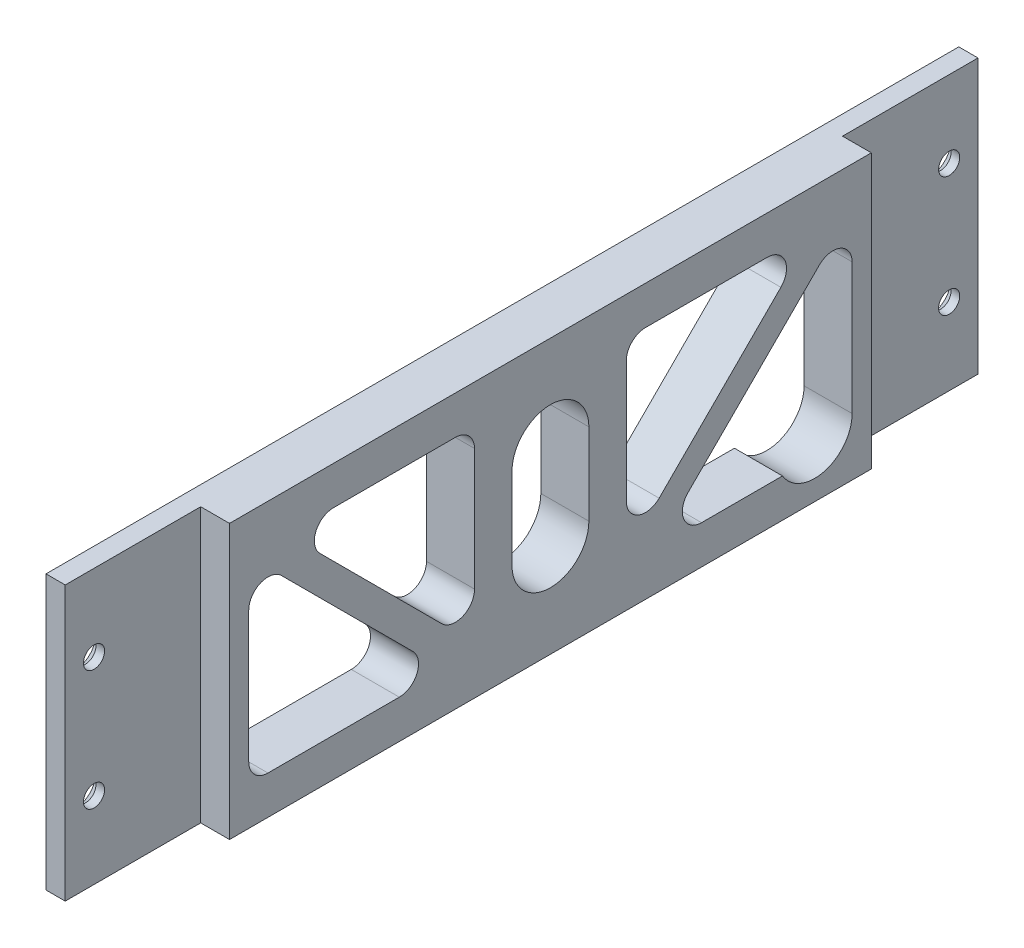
from build123d import *

# Parameters (mm, degrees)
SKETCH1_W                                           = 95
SKETCH1_H                                           = 28.5
BOSS_EXTRUDE1_DEPTH                                 = 2
SKETCH2_W                                           = 66.8
SKETCH2_H                                           = 28.5
BOSS_EXTRUDE2_DEPTH                                 = 3
CSK_FOR_M2_COUNTERSUNK_FLAT_HEAD_SCREW1_D           = 2.2
CSK_FOR_M2_COUNTERSUNK_FLAT_HEAD_SCREW1_CSINK_D     = 4.4
CSK_FOR_M2_COUNTERSUNK_FLAT_HEAD_SCREW1_CSINK_ANGLE = 90
CUT_EXTRUDE1_DEPTH                                  = 50.842878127
CUT_EXTRUDE2_DEPTH                                  = 10
SKETCH13_R                                          = 3.9
CUT_EXTRUDE3_DEPTH                                  = 10


with BuildPart() as part:
    # Sketch1 → Boss-Extrude1 (new body)
    with BuildSketch(Plane(origin=(0, 0, 0), x_dir=(0, 0, -1), z_dir=(1, 0, 0))):
        Rectangle(SKETCH1_W, SKETCH1_H)
    extrude(amount=BOSS_EXTRUDE1_DEPTH)

    # Sketch2 → Boss-Extrude2 (add)
    with BuildSketch(Plane(origin=(2, 0, 0), x_dir=(0, 0, -1), z_dir=(1, 0, 0))):
        Rectangle(SKETCH2_W, SKETCH2_H)
    extrude(amount=BOSS_EXTRUDE2_DEPTH)

    # CSK for M2 Countersunk Flat Head Screw1 (through all)
    with Locations(Plane.ZY):
        with Locations((44.5, 6.25), (44.5, -6.25), (-44.5, 6.25), (-44.5, -6.25)):
            CounterSinkHole(CSK_FOR_M2_COUNTERSUNK_FLAT_HEAD_SCREW1_D / 2, CSK_FOR_M2_COUNTERSUNK_FLAT_HEAD_SCREW1_CSINK_D / 2, counter_sink_angle=CSK_FOR_M2_COUNTERSUNK_FLAT_HEAD_SCREW1_CSINK_ANGLE)

    # Sketch9 → Cut-Extrude1 (cut, through all)
    with BuildSketch(Plane.ZY):
        with BuildLine():
            Line((-31.4, 5.421572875), (-31.4, -8.25))
            ThreePointArc((-31.4, -8.25), (-30.814213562, -9.664213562), (-29.4, -10.25))
            Line((-29.4, -10.25), (-15.728427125, -10.25))
            ThreePointArc((-15.728427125, -10.25), (-13.88066806, -9.015366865), (-14.314213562, -6.835786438))
            Line((-14.314213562, -6.835786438), (-27.985786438, 6.835786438))
            ThreePointArc((-27.985786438, 6.835786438), (-30.165366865, 7.26933194), (-31.4, 5.421572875))
        make_face()
        with BuildLine():
            Line((-22.571572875, 10.25), (-9.9, 10.25))
            ThreePointArc((-9.9, 10.25), (-8.485786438, 9.664213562), (-7.9, 8.25))
            Line((-7.9, 8.25), (-7.9, -4.421572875))
            ThreePointArc((-7.9, -4.421572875), (-9.134633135, -6.26933194), (-11.314213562, -5.835786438))
            Line((-11.314213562, -5.835786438), (-23.985786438, 6.835786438))
            ThreePointArc((-23.985786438, 6.835786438), (-24.41933194, 9.015366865), (-22.571572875, 10.25))
        make_face()
    cut_extrude1 = extrude(amount=-CUT_EXTRUDE1_DEPTH, mode=Mode.SUBTRACT)

    # Mirror1: Cut-Extrude1 across plane
    add(cut_extrude1.mirror(Plane.XY), mode=Mode.SUBTRACT)

    # Sketch10 → Cut-Extrude2 (cut)
    with BuildSketch(Plane.ZY):
        with BuildLine():
            Line((4, 4.25), (4, -4.25))
            ThreePointArc((4, -4.25), (0, -8.25), (-4, -4.25))
            Line((-4, -4.25), (-4, 4.25))
            ThreePointArc((-4, 4.25), (0, 8.25), (4, 4.25))
        make_face()
    extrude(amount=-CUT_EXTRUDE2_DEPTH, mode=Mode.SUBTRACT)

    # Sketch13 → Cut-Extrude3 (cut)
    with BuildSketch(Plane.ZY):
        with Locations((-27.5, -8.25)):
            Circle(SKETCH13_R)
    extrude(amount=-CUT_EXTRUDE3_DEPTH, mode=Mode.SUBTRACT)


solid = part.part
